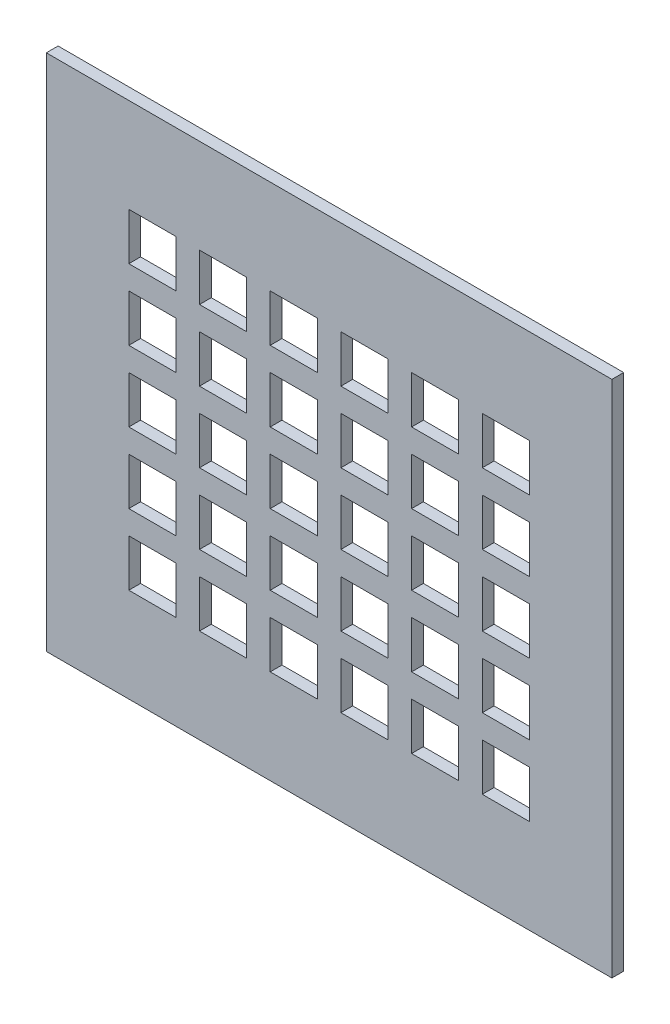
from build123d import *

# Parameters (mm, degrees)
SKETCH1_W           = 152.4
SKETCH1_H           = 139.7
BOSS_EXTRUDE1_DEPTH = 3.175
SKETCH3_W           = 12.7
SKETCH3_H           = 12.7
CUT_EXTRUDE1_DEPTH  = 104.419258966


with BuildPart() as part:
    # Sketch1 → Boss-Extrude1 (new body)
    with BuildSketch(Plane.XY):
        Rectangle(SKETCH1_W, SKETCH1_H)
    extrude(amount=BOSS_EXTRUDE1_DEPTH)

    # Sketch3 → Cut-Extrude1 (cut, through all)
    with BuildSketch(Plane.XY.offset(3.175)):
        with Locations((-47.625, -38.1)):
            Rectangle(SKETCH3_W, SKETCH3_H)
        with Locations((-28.575, -38.1)):
            Rectangle(SKETCH3_W, SKETCH3_H)
        with Locations((-9.525, -38.1)):
            Rectangle(SKETCH3_W, SKETCH3_H)
        with Locations((9.525, -38.1)):
            Rectangle(SKETCH3_W, SKETCH3_H)
        with Locations((28.575, -38.1)):
            Rectangle(SKETCH3_W, SKETCH3_H)
        with Locations((47.625, -38.1)):
            Rectangle(SKETCH3_W, SKETCH3_H)
        with Locations((-28.575, -19.05)):
            Rectangle(SKETCH3_W, SKETCH3_H)
        with Locations((-9.525, -19.05)):
            Rectangle(SKETCH3_W, SKETCH3_H)
        with Locations((9.525, -19.05)):
            Rectangle(SKETCH3_W, SKETCH3_H)
        with Locations((28.575, -19.05)):
            Rectangle(SKETCH3_W, SKETCH3_H)
        with Locations((47.625, -19.05)):
            Rectangle(SKETCH3_W, SKETCH3_H)
        with Locations((-28.575, 0)):
            Rectangle(SKETCH3_W, SKETCH3_H)
        with Locations((-9.525, 0)):
            Rectangle(SKETCH3_W, SKETCH3_H)
        with Locations((9.525, 0)):
            Rectangle(SKETCH3_W, SKETCH3_H)
        with Locations((28.575, 0)):
            Rectangle(SKETCH3_W, SKETCH3_H)
        with Locations((47.625, 0)):
            Rectangle(SKETCH3_W, SKETCH3_H)
        with Locations((-28.575, 19.05)):
            Rectangle(SKETCH3_W, SKETCH3_H)
        with Locations((-9.525, 19.05)):
            Rectangle(SKETCH3_W, SKETCH3_H)
        with Locations((9.525, 19.05)):
            Rectangle(SKETCH3_W, SKETCH3_H)
        with Locations((28.575, 19.05)):
            Rectangle(SKETCH3_W, SKETCH3_H)
        with Locations((47.625, 19.05)):
            Rectangle(SKETCH3_W, SKETCH3_H)
        with Locations((-28.575, 38.1)):
            Rectangle(SKETCH3_W, SKETCH3_H)
        with Locations((-9.525, 38.1)):
            Rectangle(SKETCH3_W, SKETCH3_H)
        with Locations((9.525, 38.1)):
            Rectangle(SKETCH3_W, SKETCH3_H)
        with Locations((28.575, 38.1)):
            Rectangle(SKETCH3_W, SKETCH3_H)
        with Locations((47.625, 38.1)):
            Rectangle(SKETCH3_W, SKETCH3_H)
        with Locations((-47.625, -19.05)):
            Rectangle(SKETCH3_W, SKETCH3_H)
        with Locations((-47.625, 0)):
            Rectangle(SKETCH3_W, SKETCH3_H)
        with Locations((-47.625, 19.05)):
            Rectangle(SKETCH3_W, SKETCH3_H)
        with Locations((-47.625, 38.1)):
            Rectangle(SKETCH3_W, SKETCH3_H)
    extrude(amount=-CUT_EXTRUDE1_DEPTH, mode=Mode.SUBTRACT)


solid = part.part
